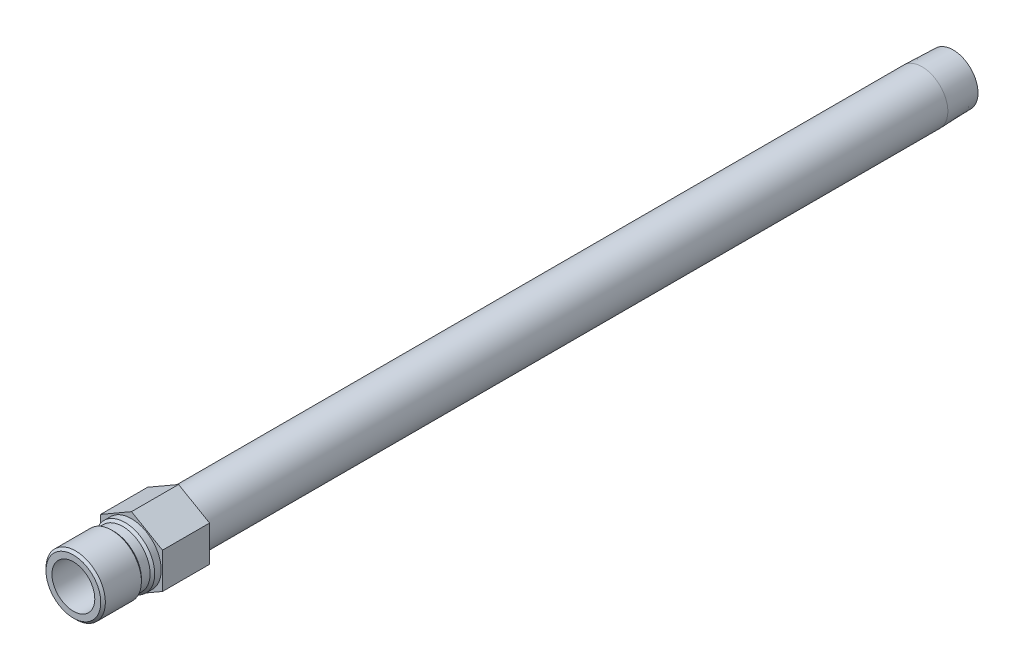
ISO-10303-21;
HEADER;
FILE_DESCRIPTION(('STEP AP214'),'2;1');
FILE_NAME('part.step','',(''),(''),'','','');
FILE_SCHEMA(('AUTOMOTIVE_DESIGN { 1 0 10303 214 1 1 1 1 }'));
ENDSEC;
DATA;
#1=APPLICATION_CONTEXT('core data for automotive mechanical design processes');
#2=APPLICATION_PROTOCOL_DEFINITION('international standard','automotive_design',2000,#1);
#3=PRODUCT_CONTEXT('',#1,'mechanical');
#4=PRODUCT('Part','Part','',(#3));
#5=PRODUCT_RELATED_PRODUCT_CATEGORY('part','',(#4));
#6=PRODUCT_DEFINITION_FORMATION('','',#4);
#7=PRODUCT_DEFINITION_CONTEXT('part definition',#1,'design');
#8=PRODUCT_DEFINITION('design','',#6,#7);
#9=PRODUCT_DEFINITION_SHAPE('','',#8);
#10=(LENGTH_UNIT() NAMED_UNIT(*) SI_UNIT(.MILLI.,.METRE.));
#11=(NAMED_UNIT(*) PLANE_ANGLE_UNIT() SI_UNIT($,.RADIAN.));
#12=(NAMED_UNIT(*) SI_UNIT($,.STERADIAN.) SOLID_ANGLE_UNIT());
#13=UNCERTAINTY_MEASURE_WITH_UNIT(LENGTH_MEASURE(1.E-05),#10,'distance_accuracy_value','');
#14=(GEOMETRIC_REPRESENTATION_CONTEXT(3) GLOBAL_UNCERTAINTY_ASSIGNED_CONTEXT((#13)) GLOBAL_UNIT_ASSIGNED_CONTEXT((#10,
#11,#12)) REPRESENTATION_CONTEXT('',''));
#15=CARTESIAN_POINT('',(0.,0.,0.));
#16=DIRECTION('',(0.,0.,1.));
#17=DIRECTION('',(1.,0.,0.));
#18=AXIS2_PLACEMENT_3D('',#15,#16,#17);
#19=CARTESIAN_POINT('',(0.,0.,0.));
#20=DIRECTION('',(0.,0.,-1.));
#21=DIRECTION('',(0.,1.,0.));
#22=AXIS2_PLACEMENT_3D('',#19,#20,#21);
#23=CYLINDRICAL_SURFACE('',#22,8.5725);
#24=CARTESIAN_POINT('',(0.,0.,-262.4582));
#25=DIRECTION('',(0.,0.,-1.));
#26=DIRECTION('',(0.,1.,0.));
#27=AXIS2_PLACEMENT_3D('',#24,#25,#26);
#28=CIRCLE('',#27,8.57250000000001);
#29=CARTESIAN_POINT('',(0.,8.5725,-262.4582));
#30=VERTEX_POINT('',#29);
#31=EDGE_CURVE('E158',#30,#30,#28,.T.);
#32=ORIENTED_EDGE('',*,*,#31,.F.);
#33=EDGE_LOOP('',(#32));
#34=FACE_BOUND('',#33,.T.);
#35=CARTESIAN_POINT('',(0.,0.,-15.621));
#36=DIRECTION('',(0.,0.,1.));
#37=DIRECTION('',(1.,0.,0.));
#38=AXIS2_PLACEMENT_3D('',#35,#36,#37);
#39=CIRCLE('',#38,8.5725);
#40=CARTESIAN_POINT('',(8.5725,0.,-15.621));
#41=VERTEX_POINT('',#40);
#42=EDGE_CURVE('E39',#41,#41,#39,.F.);
#43=ORIENTED_EDGE('',*,*,#42,.T.);
#44=EDGE_LOOP('',(#43));
#45=FACE_BOUND('',#44,.T.);
#46=ADVANCED_FACE('F35',(#34,#45),#23,.T.);
#47=CARTESIAN_POINT('',(0.,0.,0.));
#48=DIRECTION('',(0.,0.,-1.));
#49=DIRECTION('',(0.,1.,0.));
#50=AXIS2_PLACEMENT_3D('',#47,#48,#49);
#51=CYLINDRICAL_SURFACE('',#50,7.112);
#52=CARTESIAN_POINT('',(0.,0.,1.524));
#53=DIRECTION('',(0.,0.,-1.));
#54=DIRECTION('',(0.,1.,0.));
#55=AXIS2_PLACEMENT_3D('',#52,#53,#54);
#56=CIRCLE('',#55,7.112);
#57=CARTESIAN_POINT('',(0.,7.112,1.524));
#58=VERTEX_POINT('',#57);
#59=EDGE_CURVE('E146',#58,#58,#56,.T.);
#60=ORIENTED_EDGE('',*,*,#59,.T.);
#61=EDGE_LOOP('',(#60));
#62=FACE_BOUND('',#61,.T.);
#63=CARTESIAN_POINT('',(0.,0.,19.304));
#64=DIRECTION('',(0.,0.,-1.));
#65=DIRECTION('',(0.,1.,0.));
#66=AXIS2_PLACEMENT_3D('',#63,#64,#65);
#67=CIRCLE('',#66,7.112);
#68=CARTESIAN_POINT('',(0.,7.112,19.304));
#69=VERTEX_POINT('',#68);
#70=EDGE_CURVE('E11',#69,#69,#67,.T.);
#71=ORIENTED_EDGE('',*,*,#70,.F.);
#72=EDGE_LOOP('',(#71));
#73=FACE_BOUND('',#72,.T.);
#74=ADVANCED_FACE('F37',(#62,#73),#51,.F.);
#75=CARTESIAN_POINT('',(0.,7.112,19.304));
#76=DIRECTION('',(0.,0.,1.));
#77=DIRECTION('',(0.,-1.,0.));
#78=AXIS2_PLACEMENT_3D('',#75,#76,#77);
#79=PLANE('',#78);
#80=ORIENTED_EDGE('',*,*,#70,.T.);
#81=EDGE_LOOP('',(#80));
#82=FACE_BOUND('',#81,.T.);
#83=CARTESIAN_POINT('',(0.,0.,19.304));
#84=DIRECTION('',(0.,0.,-1.));
#85=DIRECTION('',(0.,1.,0.));
#86=AXIS2_PLACEMENT_3D('',#83,#84,#85);
#87=CIRCLE('',#86,9.09319999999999);
#88=CARTESIAN_POINT('',(0.,9.0932,19.304));
#89=VERTEX_POINT('',#88);
#90=EDGE_CURVE('E45',#89,#89,#87,.T.);
#91=ORIENTED_EDGE('',*,*,#90,.F.);
#92=EDGE_LOOP('',(#91));
#93=FACE_BOUND('',#92,.T.);
#94=ADVANCED_FACE('F185',(#82,#93),#79,.T.);
#95=CARTESIAN_POINT('',(0.,0.,18.542));
#96=DIRECTION('',(0.,0.,-1.));
#97=DIRECTION('',(0.,1.,0.));
#98=AXIS2_PLACEMENT_3D('',#95,#96,#97);
#99=CONICAL_SURFACE('',#98,9.8552,0.785398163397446);
#100=ORIENTED_EDGE('',*,*,#90,.T.);
#101=EDGE_LOOP('',(#100));
#102=FACE_BOUND('',#101,.T.);
#103=CARTESIAN_POINT('',(0.,0.,18.542));
#104=DIRECTION('',(0.,0.,-1.));
#105=DIRECTION('',(0.,1.,0.));
#106=AXIS2_PLACEMENT_3D('',#103,#104,#105);
#107=CIRCLE('',#106,9.8552);
#108=CARTESIAN_POINT('',(0.,9.8552,18.542));
#109=VERTEX_POINT('',#108);
#110=EDGE_CURVE('E176',#109,#109,#107,.T.);
#111=ORIENTED_EDGE('',*,*,#110,.F.);
#112=EDGE_LOOP('',(#111));
#113=FACE_BOUND('',#112,.T.);
#114=ADVANCED_FACE('F182',(#102,#113),#99,.T.);
#115=CARTESIAN_POINT('',(0.,0.,0.));
#116=DIRECTION('',(0.,0.,-1.));
#117=DIRECTION('',(0.,1.,0.));
#118=AXIS2_PLACEMENT_3D('',#115,#116,#117);
#119=CYLINDRICAL_SURFACE('',#118,9.8552);
#120=ORIENTED_EDGE('',*,*,#110,.T.);
#121=EDGE_LOOP('',(#120));
#122=FACE_BOUND('',#121,.T.);
#123=CARTESIAN_POINT('',(0.,0.,6.5786));
#124=DIRECTION('',(0.,0.,-1.));
#125=DIRECTION('',(0.,1.,0.));
#126=AXIS2_PLACEMENT_3D('',#123,#124,#125);
#127=CIRCLE('',#126,9.8552);
#128=CARTESIAN_POINT('',(0.,9.8552,6.5786));
#129=VERTEX_POINT('',#128);
#130=EDGE_CURVE('E173',#129,#129,#127,.T.);
#131=ORIENTED_EDGE('',*,*,#130,.F.);
#132=EDGE_LOOP('',(#131));
#133=FACE_BOUND('',#132,.T.);
#134=ADVANCED_FACE('F192',(#122,#133),#119,.T.);
#135=CARTESIAN_POINT('',(0.,0.,5.8166));
#136=DIRECTION('',(0.,0.,1.));
#137=DIRECTION('',(0.,-1.,0.));
#138=AXIS2_PLACEMENT_3D('',#135,#136,#137);
#139=CONICAL_SURFACE('',#138,9.0932,0.785398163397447);
#140=ORIENTED_EDGE('',*,*,#130,.T.);
#141=EDGE_LOOP('',(#140));
#142=FACE_BOUND('',#141,.T.);
#143=CARTESIAN_POINT('',(0.,0.,5.8166));
#144=DIRECTION('',(0.,0.,-1.));
#145=DIRECTION('',(0.,1.,0.));
#146=AXIS2_PLACEMENT_3D('',#143,#144,#145);
#147=CIRCLE('',#146,9.0932);
#148=CARTESIAN_POINT('',(0.,9.0932,5.8166));
#149=VERTEX_POINT('',#148);
#150=EDGE_CURVE('E170',#149,#149,#147,.T.);
#151=ORIENTED_EDGE('',*,*,#150,.F.);
#152=EDGE_LOOP('',(#151));
#153=FACE_BOUND('',#152,.T.);
#154=ADVANCED_FACE('F217',(#142,#153),#139,.T.);
#155=CARTESIAN_POINT('',(0.,0.,0.));
#156=DIRECTION('',(0.,0.,-1.));
#157=DIRECTION('',(0.,1.,0.));
#158=AXIS2_PLACEMENT_3D('',#155,#156,#157);
#159=CYLINDRICAL_SURFACE('',#158,9.0932);
#160=ORIENTED_EDGE('',*,*,#150,.T.);
#161=EDGE_LOOP('',(#160));
#162=FACE_BOUND('',#161,.T.);
#163=CARTESIAN_POINT('',(0.,0.,2.921));
#164=DIRECTION('',(0.,0.,-1.));
#165=DIRECTION('',(0.,1.,0.));
#166=AXIS2_PLACEMENT_3D('',#163,#164,#165);
#167=CIRCLE('',#166,9.0932);
#168=CARTESIAN_POINT('',(0.,9.0932,2.921));
#169=VERTEX_POINT('',#168);
#170=EDGE_CURVE('E167',#169,#169,#167,.T.);
#171=ORIENTED_EDGE('',*,*,#170,.F.);
#172=EDGE_LOOP('',(#171));
#173=FACE_BOUND('',#172,.T.);
#174=ADVANCED_FACE('F213',(#162,#173),#159,.T.);
#175=CARTESIAN_POINT('',(0.,0.,2.159));
#176=DIRECTION('',(0.,0.,-1.));
#177=DIRECTION('',(0.,1.,0.));
#178=AXIS2_PLACEMENT_3D('',#175,#176,#177);
#179=CONICAL_SURFACE('',#178,9.8552,0.785398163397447);
#180=ORIENTED_EDGE('',*,*,#170,.T.);
#181=EDGE_LOOP('',(#180));
#182=FACE_BOUND('',#181,.T.);
#183=CARTESIAN_POINT('',(0.,0.,2.159));
#184=DIRECTION('',(0.,0.,-1.));
#185=DIRECTION('',(0.,1.,0.));
#186=AXIS2_PLACEMENT_3D('',#183,#184,#185);
#187=CIRCLE('',#186,9.8552);
#188=CARTESIAN_POINT('',(0.,9.8552,2.159));
#189=VERTEX_POINT('',#188);
#190=EDGE_CURVE('E164',#189,#189,#187,.T.);
#191=ORIENTED_EDGE('',*,*,#190,.F.);
#192=EDGE_LOOP('',(#191));
#193=FACE_BOUND('',#192,.T.);
#194=ADVANCED_FACE('F209',(#182,#193),#179,.T.);
#195=CARTESIAN_POINT('',(0.,0.,0.));
#196=DIRECTION('',(0.,0.,-1.));
#197=DIRECTION('',(0.,1.,0.));
#198=AXIS2_PLACEMENT_3D('',#195,#196,#197);
#199=CYLINDRICAL_SURFACE('',#198,9.8552);
#200=ORIENTED_EDGE('',*,*,#190,.T.);
#201=EDGE_LOOP('',(#200));
#202=FACE_BOUND('',#201,.T.);
#203=CARTESIAN_POINT('',(0.,0.,0.));
#204=DIRECTION('',(0.,0.,-1.));
#205=DIRECTION('',(0.,1.,0.));
#206=AXIS2_PLACEMENT_3D('',#203,#204,#205);
#207=CIRCLE('',#206,9.8552);
#208=CARTESIAN_POINT('',(0.,9.8552,0.));
#209=VERTEX_POINT('',#208);
#210=EDGE_CURVE('E161',#209,#209,#207,.T.);
#211=ORIENTED_EDGE('',*,*,#210,.F.);
#212=EDGE_LOOP('',(#211));
#213=FACE_BOUND('',#212,.T.);
#214=ADVANCED_FACE('F206',(#202,#213),#199,.T.);
#215=CARTESIAN_POINT('',(0.,0.,-272.796));
#216=DIRECTION('',(0.,0.,1.));
#217=DIRECTION('',(0.,-1.,0.));
#218=AXIS2_PLACEMENT_3D('',#215,#216,#217);
#219=CONICAL_SURFACE('',#218,8.24944566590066,0.0312396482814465);
#220=ORIENTED_EDGE('',*,*,#31,.T.);
#221=EDGE_LOOP('',(#220));
#222=FACE_BOUND('',#221,.T.);
#223=CARTESIAN_POINT('',(0.,0.,-272.796));
#224=DIRECTION('',(0.,0.,-1.));
#225=DIRECTION('',(0.,1.,0.));
#226=AXIS2_PLACEMENT_3D('',#223,#224,#225);
#227=CIRCLE('',#226,8.24944566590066);
#228=CARTESIAN_POINT('',(0.,8.24944566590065,-272.796));
#229=VERTEX_POINT('',#228);
#230=EDGE_CURVE('E155',#229,#229,#227,.T.);
#231=ORIENTED_EDGE('',*,*,#230,.F.);
#232=EDGE_LOOP('',(#231));
#233=FACE_BOUND('',#232,.T.);
#234=ADVANCED_FACE('F204',(#222,#233),#219,.T.);
#235=CARTESIAN_POINT('',(0.,8.24944566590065,-272.796));
#236=DIRECTION('',(0.,0.,-1.));
#237=DIRECTION('',(0.,1.,0.));
#238=AXIS2_PLACEMENT_3D('',#235,#236,#237);
#239=PLANE('',#238);
#240=ORIENTED_EDGE('',*,*,#230,.T.);
#241=EDGE_LOOP('',(#240));
#242=FACE_BOUND('',#241,.T.);
#243=CARTESIAN_POINT('',(0.,0.,-272.796));
#244=DIRECTION('',(0.,0.,-1.));
#245=DIRECTION('',(0.,1.,0.));
#246=AXIS2_PLACEMENT_3D('',#243,#244,#245);
#247=CIRCLE('',#246,6.2611);
#248=CARTESIAN_POINT('',(0.,6.2611,-272.796));
#249=VERTEX_POINT('',#248);
#250=EDGE_CURVE('E152',#249,#249,#247,.T.);
#251=ORIENTED_EDGE('',*,*,#250,.F.);
#252=EDGE_LOOP('',(#251));
#253=FACE_BOUND('',#252,.T.);
#254=ADVANCED_FACE('F270',(#242,#253),#239,.T.);
#255=CARTESIAN_POINT('',(0.,0.,0.));
#256=DIRECTION('',(0.,0.,-1.));
#257=DIRECTION('',(0.,1.,0.));
#258=AXIS2_PLACEMENT_3D('',#255,#256,#257);
#259=CYLINDRICAL_SURFACE('',#258,6.2611);
#260=ORIENTED_EDGE('',*,*,#250,.T.);
#261=EDGE_LOOP('',(#260));
#262=FACE_BOUND('',#261,.T.);
#263=CARTESIAN_POINT('',(0.,0.,1.07156844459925));
#264=DIRECTION('',(0.,0.,-1.));
#265=DIRECTION('',(0.,1.,0.));
#266=AXIS2_PLACEMENT_3D('',#263,#264,#265);
#267=CIRCLE('',#266,6.2611);
#268=CARTESIAN_POINT('',(0.,6.2611,1.07156844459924));
#269=VERTEX_POINT('',#268);
#270=EDGE_CURVE('E149',#269,#269,#267,.T.);
#271=ORIENTED_EDGE('',*,*,#270,.F.);
#272=EDGE_LOOP('',(#271));
#273=FACE_BOUND('',#272,.T.);
#274=ADVANCED_FACE('F267',(#262,#273),#259,.F.);
#275=CARTESIAN_POINT('',(0.,0.,1.524));
#276=DIRECTION('',(0.,0.,1.));
#277=DIRECTION('',(0.,-1.,0.));
#278=AXIS2_PLACEMENT_3D('',#275,#276,#277);
#279=CONICAL_SURFACE('',#278,7.112,1.08210413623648);
#280=ORIENTED_EDGE('',*,*,#270,.T.);
#281=EDGE_LOOP('',(#280));
#282=FACE_BOUND('',#281,.T.);
#283=ORIENTED_EDGE('',*,*,#59,.F.);
#284=EDGE_LOOP('',(#283));
#285=FACE_BOUND('',#284,.T.);
#286=ADVANCED_FACE('F255',(#282,#285),#279,.F.);
#287=CARTESIAN_POINT('',(0.,11.8784044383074,-15.621));
#288=DIRECTION('',(-0.5,0.866025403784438,0.));
#289=DIRECTION('',(-0.866025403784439,-0.5,0.));
#290=AXIS2_PLACEMENT_3D('',#287,#288,#289);
#291=PLANE('',#290);
#292=DIRECTION('',(-0.866025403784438,-0.5,0.));
#293=VECTOR('',#292,1.);
#294=CARTESIAN_POINT('',(0.,11.8784044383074,0.));
#295=LINE('',#294,#293);
#296=CARTESIAN_POINT('',(0.,11.8784044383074,0.));
#297=VERTEX_POINT('',#296);
#298=CARTESIAN_POINT('',(-10.287,5.93920221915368,0.));
#299=VERTEX_POINT('',#298);
#300=EDGE_CURVE('E124',#297,#299,#295,.T.);
#301=ORIENTED_EDGE('',*,*,#300,.F.);
#302=DIRECTION('',(0.,0.,1.));
#303=VECTOR('',#302,1.);
#304=CARTESIAN_POINT('',(0.,11.8784044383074,-15.621));
#305=LINE('',#304,#303);
#306=CARTESIAN_POINT('',(0.,11.8784044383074,-15.621));
#307=VERTEX_POINT('',#306);
#308=EDGE_CURVE('E53',#307,#297,#305,.T.);
#309=ORIENTED_EDGE('',*,*,#308,.F.);
#310=DIRECTION('',(-0.866025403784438,-0.5,0.));
#311=VECTOR('',#310,1.);
#312=CARTESIAN_POINT('',(0.,11.8784044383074,-15.621));
#313=LINE('',#312,#311);
#314=CARTESIAN_POINT('',(-10.287,5.93920221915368,-15.621));
#315=VERTEX_POINT('',#314);
#316=EDGE_CURVE('E139',#307,#315,#313,.T.);
#317=ORIENTED_EDGE('',*,*,#316,.T.);
#318=DIRECTION('',(0.,0.,1.));
#319=VECTOR('',#318,1.);
#320=CARTESIAN_POINT('',(-10.287,5.93920221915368,-15.621));
#321=LINE('',#320,#319);
#322=EDGE_CURVE('E88',#315,#299,#321,.T.);
#323=ORIENTED_EDGE('',*,*,#322,.T.);
#324=EDGE_LOOP('',(#301,#309,#317,#323));
#325=FACE_BOUND('',#324,.T.);
#326=ADVANCED_FACE('F242',(#325),#291,.T.);
#327=CARTESIAN_POINT('',(10.287,5.93920221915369,-15.621));
#328=DIRECTION('',(0.5,0.866025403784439,0.));
#329=DIRECTION('',(-0.866025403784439,0.5,0.));
#330=AXIS2_PLACEMENT_3D('',#327,#328,#329);
#331=PLANE('',#330);
#332=DIRECTION('',(-0.866025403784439,0.5,0.));
#333=VECTOR('',#332,1.);
#334=CARTESIAN_POINT('',(10.287,5.93920221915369,0.));
#335=LINE('',#334,#333);
#336=CARTESIAN_POINT('',(10.287,5.93920221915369,0.));
#337=VERTEX_POINT('',#336);
#338=EDGE_CURVE('E136',#337,#297,#335,.T.);
#339=ORIENTED_EDGE('',*,*,#338,.F.);
#340=DIRECTION('',(0.,0.,1.));
#341=VECTOR('',#340,1.);
#342=CARTESIAN_POINT('',(10.287,5.93920221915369,-15.621));
#343=LINE('',#342,#341);
#344=CARTESIAN_POINT('',(10.287,5.93920221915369,-15.621));
#345=VERTEX_POINT('',#344);
#346=EDGE_CURVE('E76',#345,#337,#343,.T.);
#347=ORIENTED_EDGE('',*,*,#346,.F.);
#348=DIRECTION('',(-0.866025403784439,0.5,0.));
#349=VECTOR('',#348,1.);
#350=CARTESIAN_POINT('',(10.287,5.93920221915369,-15.621));
#351=LINE('',#350,#349);
#352=EDGE_CURVE('E114',#345,#307,#351,.T.);
#353=ORIENTED_EDGE('',*,*,#352,.T.);
#354=ORIENTED_EDGE('',*,*,#308,.T.);
#355=EDGE_LOOP('',(#339,#347,#353,#354));
#356=FACE_BOUND('',#355,.T.);
#357=ADVANCED_FACE('F247',(#356),#331,.T.);
#358=CARTESIAN_POINT('',(10.287,-5.93920221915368,-15.621));
#359=DIRECTION('',(1.,0.,0.));
#360=DIRECTION('',(0.,0.,-1.));
#361=AXIS2_PLACEMENT_3D('',#358,#359,#360);
#362=PLANE('',#361);
#363=DIRECTION('',(0.,1.,0.));
#364=VECTOR('',#363,1.);
#365=CARTESIAN_POINT('',(10.287,-5.93920221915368,0.));
#366=LINE('',#365,#364);
#367=CARTESIAN_POINT('',(10.287,-5.93920221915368,0.));
#368=VERTEX_POINT('',#367);
#369=EDGE_CURVE('E101',#368,#337,#366,.T.);
#370=ORIENTED_EDGE('',*,*,#369,.F.);
#371=DIRECTION('',(0.,0.,1.));
#372=VECTOR('',#371,1.);
#373=CARTESIAN_POINT('',(10.287,-5.93920221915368,-15.621));
#374=LINE('',#373,#372);
#375=CARTESIAN_POINT('',(10.287,-5.93920221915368,-15.621));
#376=VERTEX_POINT('',#375);
#377=EDGE_CURVE('E96',#376,#368,#374,.T.);
#378=ORIENTED_EDGE('',*,*,#377,.F.);
#379=DIRECTION('',(0.,1.,0.));
#380=VECTOR('',#379,1.);
#381=CARTESIAN_POINT('',(10.287,-5.93920221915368,-15.621));
#382=LINE('',#381,#380);
#383=EDGE_CURVE('E99',#376,#345,#382,.T.);
#384=ORIENTED_EDGE('',*,*,#383,.T.);
#385=ORIENTED_EDGE('',*,*,#346,.T.);
#386=EDGE_LOOP('',(#370,#378,#384,#385));
#387=FACE_BOUND('',#386,.T.);
#388=ADVANCED_FACE('F98',(#387),#362,.T.);
#389=CARTESIAN_POINT('',(0.,-11.8784044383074,-15.621));
#390=DIRECTION('',(0.5,-0.866025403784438,0.));
#391=DIRECTION('',(0.866025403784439,0.5,0.));
#392=AXIS2_PLACEMENT_3D('',#389,#390,#391);
#393=PLANE('',#392);
#394=DIRECTION('',(0.866025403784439,0.5,0.));
#395=VECTOR('',#394,1.);
#396=CARTESIAN_POINT('',(0.,-11.8784044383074,0.));
#397=LINE('',#396,#395);
#398=CARTESIAN_POINT('',(0.,-11.8784044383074,0.));
#399=VERTEX_POINT('',#398);
#400=EDGE_CURVE('E133',#399,#368,#397,.T.);
#401=ORIENTED_EDGE('',*,*,#400,.F.);
#402=DIRECTION('',(0.,0.,1.));
#403=VECTOR('',#402,1.);
#404=CARTESIAN_POINT('',(0.,-11.8784044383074,-15.621));
#405=LINE('',#404,#403);
#406=CARTESIAN_POINT('',(0.,-11.8784044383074,-15.621));
#407=VERTEX_POINT('',#406);
#408=EDGE_CURVE('E106',#407,#399,#405,.T.);
#409=ORIENTED_EDGE('',*,*,#408,.F.);
#410=DIRECTION('',(0.866025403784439,0.5,0.));
#411=VECTOR('',#410,1.);
#412=CARTESIAN_POINT('',(0.,-11.8784044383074,-15.621));
#413=LINE('',#412,#411);
#414=EDGE_CURVE('E112',#407,#376,#413,.T.);
#415=ORIENTED_EDGE('',*,*,#414,.T.);
#416=ORIENTED_EDGE('',*,*,#377,.T.);
#417=EDGE_LOOP('',(#401,#409,#415,#416));
#418=FACE_BOUND('',#417,.T.);
#419=ADVANCED_FACE('F116',(#418),#393,.T.);
#420=CARTESIAN_POINT('',(-10.287,-5.93920221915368,-15.621));
#421=DIRECTION('',(-0.5,-0.866025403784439,0.));
#422=DIRECTION('',(0.866025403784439,-0.5,0.));
#423=AXIS2_PLACEMENT_3D('',#420,#421,#422);
#424=PLANE('',#423);
#425=DIRECTION('',(0.866025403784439,-0.5,0.));
#426=VECTOR('',#425,1.);
#427=CARTESIAN_POINT('',(-10.287,-5.93920221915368,0.));
#428=LINE('',#427,#426);
#429=CARTESIAN_POINT('',(-10.287,-5.93920221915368,0.));
#430=VERTEX_POINT('',#429);
#431=EDGE_CURVE('E130',#430,#399,#428,.T.);
#432=ORIENTED_EDGE('',*,*,#431,.F.);
#433=DIRECTION('',(0.,0.,1.));
#434=VECTOR('',#433,1.);
#435=CARTESIAN_POINT('',(-10.287,-5.93920221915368,-15.621));
#436=LINE('',#435,#434);
#437=CARTESIAN_POINT('',(-10.287,-5.93920221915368,-15.621));
#438=VERTEX_POINT('',#437);
#439=EDGE_CURVE('E143',#438,#430,#436,.T.);
#440=ORIENTED_EDGE('',*,*,#439,.F.);
#441=DIRECTION('',(0.866025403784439,-0.5,0.));
#442=VECTOR('',#441,1.);
#443=CARTESIAN_POINT('',(-10.287,-5.93920221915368,-15.621));
#444=LINE('',#443,#442);
#445=EDGE_CURVE('E117',#438,#407,#444,.T.);
#446=ORIENTED_EDGE('',*,*,#445,.T.);
#447=ORIENTED_EDGE('',*,*,#408,.T.);
#448=EDGE_LOOP('',(#432,#440,#446,#447));
#449=FACE_BOUND('',#448,.T.);
#450=ADVANCED_FACE('F246',(#449),#424,.T.);
#451=CARTESIAN_POINT('',(-10.287,5.93920221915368,-15.621));
#452=DIRECTION('',(-1.,0.,0.));
#453=DIRECTION('',(0.,0.,1.));
#454=AXIS2_PLACEMENT_3D('',#451,#452,#453);
#455=PLANE('',#454);
#456=DIRECTION('',(0.,-1.,0.));
#457=VECTOR('',#456,1.);
#458=CARTESIAN_POINT('',(-10.287,5.93920221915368,0.));
#459=LINE('',#458,#457);
#460=EDGE_CURVE('E127',#299,#430,#459,.T.);
#461=ORIENTED_EDGE('',*,*,#460,.F.);
#462=ORIENTED_EDGE('',*,*,#322,.F.);
#463=DIRECTION('',(0.,-1.,0.));
#464=VECTOR('',#463,1.);
#465=CARTESIAN_POINT('',(-10.287,5.93920221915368,-15.621));
#466=LINE('',#465,#464);
#467=EDGE_CURVE('E119',#315,#438,#466,.T.);
#468=ORIENTED_EDGE('',*,*,#467,.T.);
#469=ORIENTED_EDGE('',*,*,#439,.T.);
#470=EDGE_LOOP('',(#461,#462,#468,#469));
#471=FACE_BOUND('',#470,.T.);
#472=ADVANCED_FACE('F243',(#471),#455,.T.);
#473=CARTESIAN_POINT('',(-10.287,5.93920221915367,-15.621));
#474=DIRECTION('',(0.,0.,1.));
#475=DIRECTION('',(1.,0.,0.));
#476=AXIS2_PLACEMENT_3D('',#473,#474,#475);
#477=PLANE('',#476);
#478=ORIENTED_EDGE('',*,*,#42,.F.);
#479=EDGE_LOOP('',(#478));
#480=FACE_BOUND('',#479,.T.);
#481=ORIENTED_EDGE('',*,*,#316,.F.);
#482=ORIENTED_EDGE('',*,*,#352,.F.);
#483=ORIENTED_EDGE('',*,*,#383,.F.);
#484=ORIENTED_EDGE('',*,*,#414,.F.);
#485=ORIENTED_EDGE('',*,*,#445,.F.);
#486=ORIENTED_EDGE('',*,*,#467,.F.);
#487=EDGE_LOOP('',(#481,#482,#483,#484,#485,#486));
#488=FACE_BOUND('',#487,.T.);
#489=ADVANCED_FACE('F110',(#480,#488),#477,.F.);
#490=CARTESIAN_POINT('',(-10.287,5.93920221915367,0.));
#491=DIRECTION('',(0.,0.,1.));
#492=DIRECTION('',(1.,0.,0.));
#493=AXIS2_PLACEMENT_3D('',#490,#491,#492);
#494=PLANE('',#493);
#495=ORIENTED_EDGE('',*,*,#210,.T.);
#496=EDGE_LOOP('',(#495));
#497=FACE_BOUND('',#496,.T.);
#498=ORIENTED_EDGE('',*,*,#300,.T.);
#499=ORIENTED_EDGE('',*,*,#460,.T.);
#500=ORIENTED_EDGE('',*,*,#431,.T.);
#501=ORIENTED_EDGE('',*,*,#400,.T.);
#502=ORIENTED_EDGE('',*,*,#369,.T.);
#503=ORIENTED_EDGE('',*,*,#338,.T.);
#504=EDGE_LOOP('',(#498,#499,#500,#501,#502,#503));
#505=FACE_BOUND('',#504,.T.);
#506=ADVANCED_FACE('F238',(#497,#505),#494,.T.);
#507=CLOSED_SHELL('',(#46,#74,#94,#114,#134,#154,#174,#194,#214,#234,#254,#274,#286,#326,#357,
#388,#419,#450,#472,#489,#506));
#508=MANIFOLD_SOLID_BREP('B2',#507);
#509=ADVANCED_BREP_SHAPE_REPRESENTATION('',(#18,#508),#14);
#510=SHAPE_DEFINITION_REPRESENTATION(#9,#509);
ENDSEC;
END-ISO-10303-21;
